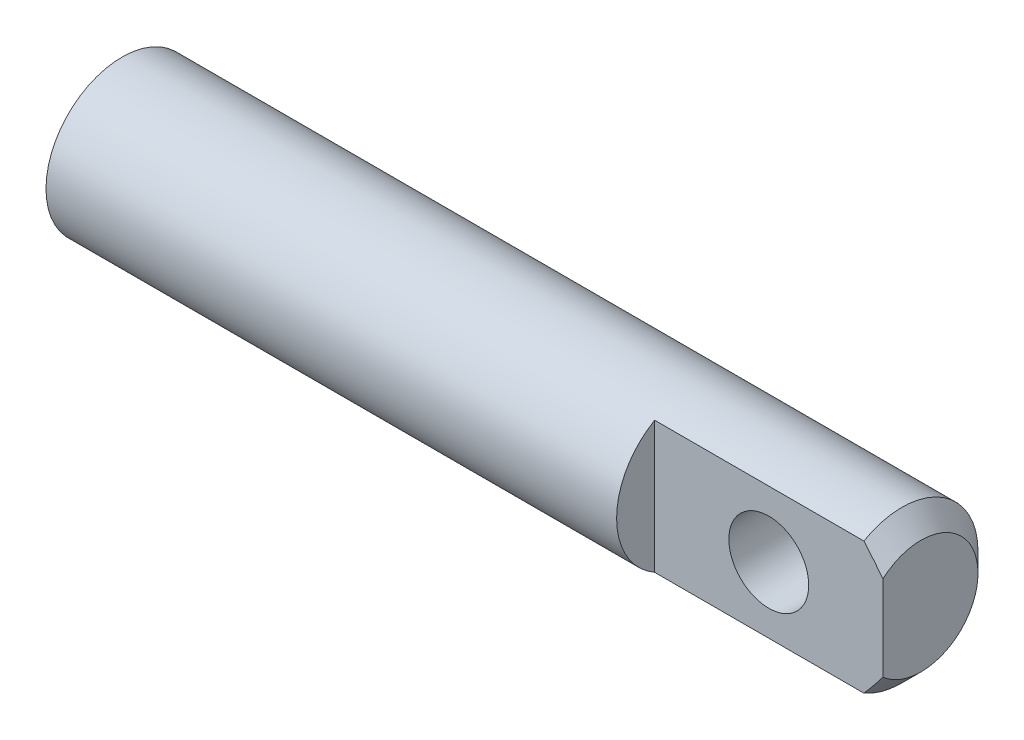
from build123d import *

# Parameters (mm, degrees)
CUT_EXTRUDE3_DEPTH = 6
SKETCH5_R          = 1.05
CUT_EXTRUDE4_DEPTH = 22.307275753


with BuildPart() as part:
    # Sketch1 → Revolve1 (revolve)
    with BuildSketch(Plane.XY, mode=Mode.PRIVATE) as revolve1_sk:
        Polygon((0, 0), (0, 2), (20.5, 2), (21, 1.5), (21, 0), align=None)
    revolve(revolve1_sk.sketch.rotate(Axis((0, 0, 0), (1, 0, 0)), 90), axis=Axis((0, 0, 0), (1, 0, 0)))

    # Sketch4 → Cut-Extrude3 (cut)
    with BuildSketch(Plane(origin=(21, 0, 0), x_dir=(0, 0, -1), z_dir=(1, 0, 0))):
        with BuildLine():
            Line((-1, 1.732050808), (-1, -1.732050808))
            ThreePointArc((-1, -1.732050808), (-2, 0), (-1, 1.732050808))
        make_face()
    extrude(amount=-CUT_EXTRUDE3_DEPTH, mode=Mode.SUBTRACT)

    # Sketch5 → Cut-Extrude4 (cut, through all)
    with BuildSketch(Plane.XY.offset(1)):
        with Locations((18, 0)):
            Circle(SKETCH5_R)
    extrude(amount=-CUT_EXTRUDE4_DEPTH, mode=Mode.SUBTRACT)


solid = part.part
